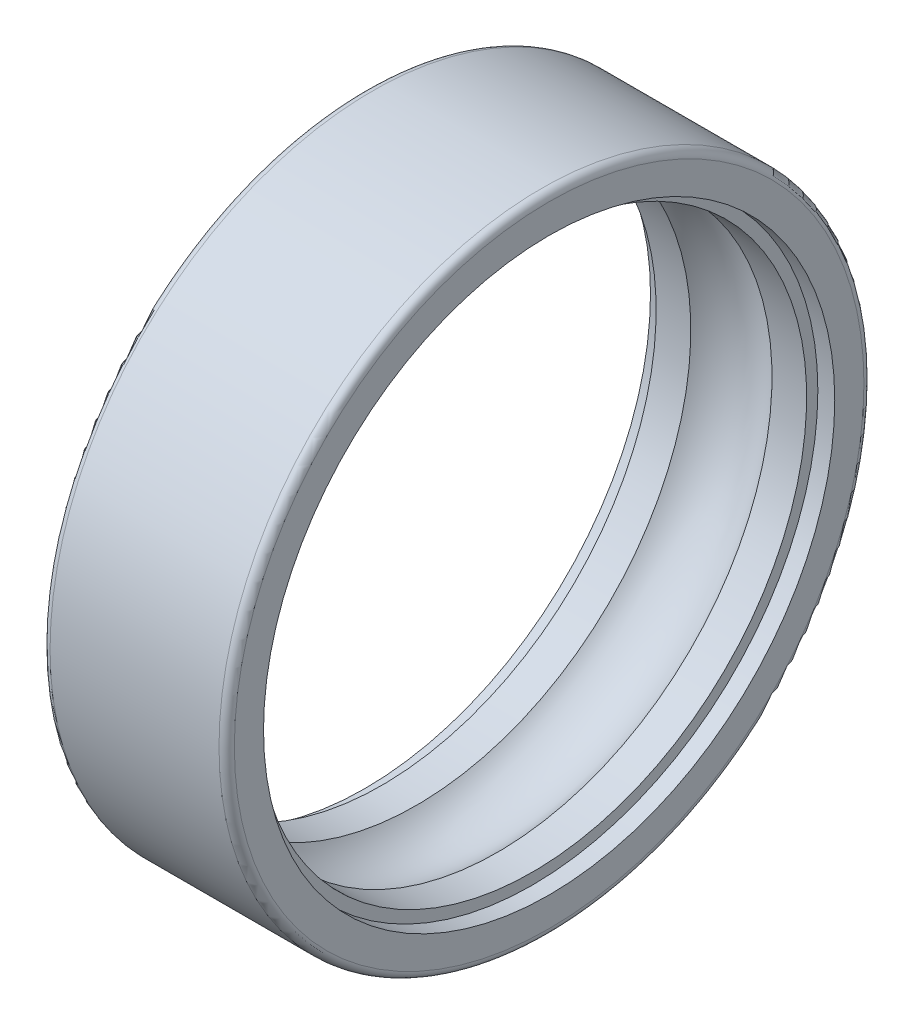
ISO-10303-21;
HEADER;
FILE_DESCRIPTION(('STEP AP214'),'2;1');
FILE_NAME('part.step','',(''),(''),'','','');
FILE_SCHEMA(('AUTOMOTIVE_DESIGN { 1 0 10303 214 1 1 1 1 }'));
ENDSEC;
DATA;
#1=APPLICATION_CONTEXT('core data for automotive mechanical design processes');
#2=APPLICATION_PROTOCOL_DEFINITION('international standard','automotive_design',2000,#1);
#3=PRODUCT_CONTEXT('',#1,'mechanical');
#4=PRODUCT('Part','Part','',(#3));
#5=PRODUCT_RELATED_PRODUCT_CATEGORY('part','',(#4));
#6=PRODUCT_DEFINITION_FORMATION('','',#4);
#7=PRODUCT_DEFINITION_CONTEXT('part definition',#1,'design');
#8=PRODUCT_DEFINITION('design','',#6,#7);
#9=PRODUCT_DEFINITION_SHAPE('','',#8);
#10=(LENGTH_UNIT() NAMED_UNIT(*) SI_UNIT(.MILLI.,.METRE.));
#11=(NAMED_UNIT(*) PLANE_ANGLE_UNIT() SI_UNIT($,.RADIAN.));
#12=(NAMED_UNIT(*) SI_UNIT($,.STERADIAN.) SOLID_ANGLE_UNIT());
#13=UNCERTAINTY_MEASURE_WITH_UNIT(LENGTH_MEASURE(1.E-05),#10,'distance_accuracy_value','');
#14=(GEOMETRIC_REPRESENTATION_CONTEXT(3) GLOBAL_UNCERTAINTY_ASSIGNED_CONTEXT((#13)) GLOBAL_UNIT_ASSIGNED_CONTEXT((#10,
#11,#12)) REPRESENTATION_CONTEXT('',''));
#15=CARTESIAN_POINT('',(0.,0.,0.));
#16=DIRECTION('',(0.,0.,1.));
#17=DIRECTION('',(1.,0.,0.));
#18=AXIS2_PLACEMENT_3D('',#15,#16,#17);
#19=CARTESIAN_POINT('',(-4.9,18.6,0.));
#20=DIRECTION('',(1.,0.,0.));
#21=DIRECTION('',(0.,0.,-1.));
#22=AXIS2_PLACEMENT_3D('',#19,#20,#21);
#23=PLANE('',#22);
#24=CARTESIAN_POINT('',(-4.9,0.,0.));
#25=DIRECTION('',(-1.,0.,0.));
#26=DIRECTION('',(0.,0.,1.));
#27=AXIS2_PLACEMENT_3D('',#24,#25,#26);
#28=CIRCLE('',#27,17.87);
#29=CARTESIAN_POINT('',(-4.9,0.,17.87));
#30=VERTEX_POINT('',#29);
#31=EDGE_CURVE('E10',#30,#30,#28,.T.);
#32=ORIENTED_EDGE('',*,*,#31,.F.);
#33=EDGE_LOOP('',(#32));
#34=FACE_BOUND('',#33,.T.);
#35=CARTESIAN_POINT('',(-4.9,0.,0.));
#36=DIRECTION('',(-1.,0.,0.));
#37=DIRECTION('',(0.,0.,1.));
#38=AXIS2_PLACEMENT_3D('',#35,#36,#37);
#39=CIRCLE('',#38,18.6);
#40=CARTESIAN_POINT('',(-4.9,0.,18.6));
#41=VERTEX_POINT('',#40);
#42=EDGE_CURVE('E71',#41,#41,#39,.T.);
#43=ORIENTED_EDGE('',*,*,#42,.T.);
#44=EDGE_LOOP('',(#43));
#45=FACE_BOUND('',#44,.T.);
#46=ADVANCED_FACE('F31',(#34,#45),#23,.F.);
#47=CARTESIAN_POINT('',(-18.287314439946,0.,0.));
#48=DIRECTION('',(-1.,0.,0.));
#49=DIRECTION('',(0.,0.,1.));
#50=AXIS2_PLACEMENT_3D('',#47,#48,#49);
#51=CYLINDRICAL_SURFACE('',#50,17.87);
#52=CARTESIAN_POINT('',(-2.64302856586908,0.,0.));
#53=DIRECTION('',(-1.,0.,0.));
#54=DIRECTION('',(0.,0.,1.));
#55=AXIS2_PLACEMENT_3D('',#52,#53,#54);
#56=CIRCLE('',#55,17.87);
#57=CARTESIAN_POINT('',(-2.64302856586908,0.,17.87));
#58=VERTEX_POINT('',#57);
#59=EDGE_CURVE('E37',#58,#58,#56,.T.);
#60=ORIENTED_EDGE('',*,*,#59,.F.);
#61=EDGE_LOOP('',(#60));
#62=FACE_BOUND('',#61,.T.);
#63=ORIENTED_EDGE('',*,*,#31,.T.);
#64=EDGE_LOOP('',(#63));
#65=FACE_BOUND('',#64,.T.);
#66=ADVANCED_FACE('F132',(#62,#65),#51,.F.);
#67=CARTESIAN_POINT('',(0.,0.,0.));
#68=DIRECTION('',(-1.,0.,0.));
#69=DIRECTION('',(0.,0.,1.));
#70=AXIS2_PLACEMENT_3D('',#67,#68,#69);
#71=TOROIDAL_SURFACE('',#70,15.5,3.55);
#72=CARTESIAN_POINT('',(2.64302856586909,0.,0.));
#73=DIRECTION('',(-1.,0.,0.));
#74=DIRECTION('',(0.,0.,1.));
#75=AXIS2_PLACEMENT_3D('',#72,#73,#74);
#76=CIRCLE('',#75,17.87);
#77=CARTESIAN_POINT('',(2.64302856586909,0.,17.87));
#78=VERTEX_POINT('',#77);
#79=EDGE_CURVE('E41',#78,#78,#76,.T.);
#80=ORIENTED_EDGE('',*,*,#79,.F.);
#81=EDGE_LOOP('',(#80));
#82=FACE_BOUND('',#81,.T.);
#83=ORIENTED_EDGE('',*,*,#59,.T.);
#84=EDGE_LOOP('',(#83));
#85=FACE_BOUND('',#84,.T.);
#86=ADVANCED_FACE('F127',(#82,#85),#71,.F.);
#87=CARTESIAN_POINT('',(-18.287314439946,0.,0.));
#88=DIRECTION('',(-1.,0.,0.));
#89=DIRECTION('',(0.,0.,1.));
#90=AXIS2_PLACEMENT_3D('',#87,#88,#89);
#91=CYLINDRICAL_SURFACE('',#90,17.87);
#92=CARTESIAN_POINT('',(4.9,0.,0.));
#93=DIRECTION('',(-1.,0.,0.));
#94=DIRECTION('',(0.,0.,1.));
#95=AXIS2_PLACEMENT_3D('',#92,#93,#94);
#96=CIRCLE('',#95,17.87);
#97=CARTESIAN_POINT('',(4.9,0.,17.87));
#98=VERTEX_POINT('',#97);
#99=EDGE_CURVE('E45',#98,#98,#96,.T.);
#100=ORIENTED_EDGE('',*,*,#99,.F.);
#101=EDGE_LOOP('',(#100));
#102=FACE_BOUND('',#101,.T.);
#103=ORIENTED_EDGE('',*,*,#79,.T.);
#104=EDGE_LOOP('',(#103));
#105=FACE_BOUND('',#104,.T.);
#106=ADVANCED_FACE('F121',(#102,#105),#91,.F.);
#107=CARTESIAN_POINT('',(4.9,18.6,0.));
#108=DIRECTION('',(-1.,0.,0.));
#109=DIRECTION('',(0.,0.,1.));
#110=AXIS2_PLACEMENT_3D('',#107,#108,#109);
#111=PLANE('',#110);
#112=CARTESIAN_POINT('',(4.9,0.,0.));
#113=DIRECTION('',(-1.,0.,0.));
#114=DIRECTION('',(0.,0.,1.));
#115=AXIS2_PLACEMENT_3D('',#112,#113,#114);
#116=CIRCLE('',#115,18.6);
#117=CARTESIAN_POINT('',(4.9,0.,18.6));
#118=VERTEX_POINT('',#117);
#119=EDGE_CURVE('E50',#118,#118,#116,.T.);
#120=ORIENTED_EDGE('',*,*,#119,.F.);
#121=EDGE_LOOP('',(#120));
#122=FACE_BOUND('',#121,.T.);
#123=ORIENTED_EDGE('',*,*,#99,.T.);
#124=EDGE_LOOP('',(#123));
#125=FACE_BOUND('',#124,.T.);
#126=ADVANCED_FACE('F115',(#122,#125),#111,.F.);
#127=CARTESIAN_POINT('',(-18.287314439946,0.,0.));
#128=DIRECTION('',(-1.,0.,0.));
#129=DIRECTION('',(0.,0.,1.));
#130=AXIS2_PLACEMENT_3D('',#127,#128,#129);
#131=CYLINDRICAL_SURFACE('',#130,18.6);
#132=CARTESIAN_POINT('',(6.,0.,0.));
#133=DIRECTION('',(-1.,0.,0.));
#134=DIRECTION('',(0.,0.,1.));
#135=AXIS2_PLACEMENT_3D('',#132,#133,#134);
#136=CIRCLE('',#135,18.6);
#137=CARTESIAN_POINT('',(6.,0.,18.6));
#138=VERTEX_POINT('',#137);
#139=EDGE_CURVE('E53',#138,#138,#136,.T.);
#140=ORIENTED_EDGE('',*,*,#139,.F.);
#141=EDGE_LOOP('',(#140));
#142=FACE_BOUND('',#141,.T.);
#143=ORIENTED_EDGE('',*,*,#119,.T.);
#144=EDGE_LOOP('',(#143));
#145=FACE_BOUND('',#144,.T.);
#146=ADVANCED_FACE('F109',(#142,#145),#131,.F.);
#147=CARTESIAN_POINT('',(6.,20.5,0.));
#148=DIRECTION('',(-1.,0.,0.));
#149=DIRECTION('',(0.,0.,1.));
#150=AXIS2_PLACEMENT_3D('',#147,#148,#149);
#151=PLANE('',#150);
#152=CARTESIAN_POINT('',(6.,0.,0.));
#153=DIRECTION('',(-1.,0.,0.));
#154=DIRECTION('',(0.,0.,1.));
#155=AXIS2_PLACEMENT_3D('',#152,#153,#154);
#156=CIRCLE('',#155,20.5);
#157=CARTESIAN_POINT('',(6.,0.,20.5));
#158=VERTEX_POINT('',#157);
#159=EDGE_CURVE('E56',#158,#158,#156,.T.);
#160=ORIENTED_EDGE('',*,*,#159,.F.);
#161=EDGE_LOOP('',(#160));
#162=FACE_BOUND('',#161,.T.);
#163=ORIENTED_EDGE('',*,*,#139,.T.);
#164=EDGE_LOOP('',(#163));
#165=FACE_BOUND('',#164,.T.);
#166=ADVANCED_FACE('F103',(#162,#165),#151,.F.);
#167=CARTESIAN_POINT('',(5.5,0.,0.));
#168=DIRECTION('',(-1.,0.,0.));
#169=DIRECTION('',(0.,0.,1.));
#170=AXIS2_PLACEMENT_3D('',#167,#168,#169);
#171=TOROIDAL_SURFACE('',#170,20.5,0.5);
#172=CARTESIAN_POINT('',(5.5,0.,0.));
#173=DIRECTION('',(-1.,0.,0.));
#174=DIRECTION('',(0.,0.,1.));
#175=AXIS2_PLACEMENT_3D('',#172,#173,#174);
#176=CIRCLE('',#175,21.);
#177=CARTESIAN_POINT('',(5.5,0.,21.));
#178=VERTEX_POINT('',#177);
#179=EDGE_CURVE('E59',#178,#178,#176,.T.);
#180=ORIENTED_EDGE('',*,*,#179,.F.);
#181=EDGE_LOOP('',(#180));
#182=FACE_BOUND('',#181,.T.);
#183=ORIENTED_EDGE('',*,*,#159,.T.);
#184=EDGE_LOOP('',(#183));
#185=FACE_BOUND('',#184,.T.);
#186=ADVANCED_FACE('F97',(#182,#185),#171,.T.);
#187=CARTESIAN_POINT('',(-18.287314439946,0.,0.));
#188=DIRECTION('',(-1.,0.,0.));
#189=DIRECTION('',(0.,0.,1.));
#190=AXIS2_PLACEMENT_3D('',#187,#188,#189);
#191=CYLINDRICAL_SURFACE('',#190,21.);
#192=CARTESIAN_POINT('',(-5.5,0.,0.));
#193=DIRECTION('',(-1.,0.,0.));
#194=DIRECTION('',(0.,0.,1.));
#195=AXIS2_PLACEMENT_3D('',#192,#193,#194);
#196=CIRCLE('',#195,21.);
#197=CARTESIAN_POINT('',(-5.5,0.,21.));
#198=VERTEX_POINT('',#197);
#199=EDGE_CURVE('E62',#198,#198,#196,.T.);
#200=ORIENTED_EDGE('',*,*,#199,.F.);
#201=EDGE_LOOP('',(#200));
#202=FACE_BOUND('',#201,.T.);
#203=ORIENTED_EDGE('',*,*,#179,.T.);
#204=EDGE_LOOP('',(#203));
#205=FACE_BOUND('',#204,.T.);
#206=ADVANCED_FACE('F91',(#202,#205),#191,.T.);
#207=CARTESIAN_POINT('',(-5.5,0.,0.));
#208=DIRECTION('',(-1.,0.,0.));
#209=DIRECTION('',(0.,0.,1.));
#210=AXIS2_PLACEMENT_3D('',#207,#208,#209);
#211=TOROIDAL_SURFACE('',#210,20.5,0.5);
#212=CARTESIAN_POINT('',(-6.,0.,0.));
#213=DIRECTION('',(-1.,0.,0.));
#214=DIRECTION('',(0.,0.,1.));
#215=AXIS2_PLACEMENT_3D('',#212,#213,#214);
#216=CIRCLE('',#215,20.5);
#217=CARTESIAN_POINT('',(-6.,0.,20.5));
#218=VERTEX_POINT('',#217);
#219=EDGE_CURVE('E65',#218,#218,#216,.T.);
#220=ORIENTED_EDGE('',*,*,#219,.F.);
#221=EDGE_LOOP('',(#220));
#222=FACE_BOUND('',#221,.T.);
#223=ORIENTED_EDGE('',*,*,#199,.T.);
#224=EDGE_LOOP('',(#223));
#225=FACE_BOUND('',#224,.T.);
#226=ADVANCED_FACE('F85',(#222,#225),#211,.T.);
#227=CARTESIAN_POINT('',(-6.,20.5,0.));
#228=DIRECTION('',(1.,0.,0.));
#229=DIRECTION('',(0.,0.,-1.));
#230=AXIS2_PLACEMENT_3D('',#227,#228,#229);
#231=PLANE('',#230);
#232=CARTESIAN_POINT('',(-6.,0.,0.));
#233=DIRECTION('',(-1.,0.,0.));
#234=DIRECTION('',(0.,0.,1.));
#235=AXIS2_PLACEMENT_3D('',#232,#233,#234);
#236=CIRCLE('',#235,18.6);
#237=CARTESIAN_POINT('',(-6.,0.,18.6));
#238=VERTEX_POINT('',#237);
#239=EDGE_CURVE('E68',#238,#238,#236,.T.);
#240=ORIENTED_EDGE('',*,*,#239,.F.);
#241=EDGE_LOOP('',(#240));
#242=FACE_BOUND('',#241,.T.);
#243=ORIENTED_EDGE('',*,*,#219,.T.);
#244=EDGE_LOOP('',(#243));
#245=FACE_BOUND('',#244,.T.);
#246=ADVANCED_FACE('F79',(#242,#245),#231,.F.);
#247=CARTESIAN_POINT('',(-18.287314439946,0.,0.));
#248=DIRECTION('',(-1.,0.,0.));
#249=DIRECTION('',(0.,0.,1.));
#250=AXIS2_PLACEMENT_3D('',#247,#248,#249);
#251=CYLINDRICAL_SURFACE('',#250,18.6);
#252=ORIENTED_EDGE('',*,*,#42,.F.);
#253=EDGE_LOOP('',(#252));
#254=FACE_BOUND('',#253,.T.);
#255=ORIENTED_EDGE('',*,*,#239,.T.);
#256=EDGE_LOOP('',(#255));
#257=FACE_BOUND('',#256,.T.);
#258=ADVANCED_FACE('F76',(#254,#257),#251,.F.);
#259=CLOSED_SHELL('',(#46,#66,#86,#106,#126,#146,#166,#186,#206,#226,#246,#258));
#260=MANIFOLD_SOLID_BREP('B2',#259);
#261=ADVANCED_BREP_SHAPE_REPRESENTATION('',(#18,#260),#14);
#262=SHAPE_DEFINITION_REPRESENTATION(#9,#261);
ENDSEC;
END-ISO-10303-21;
